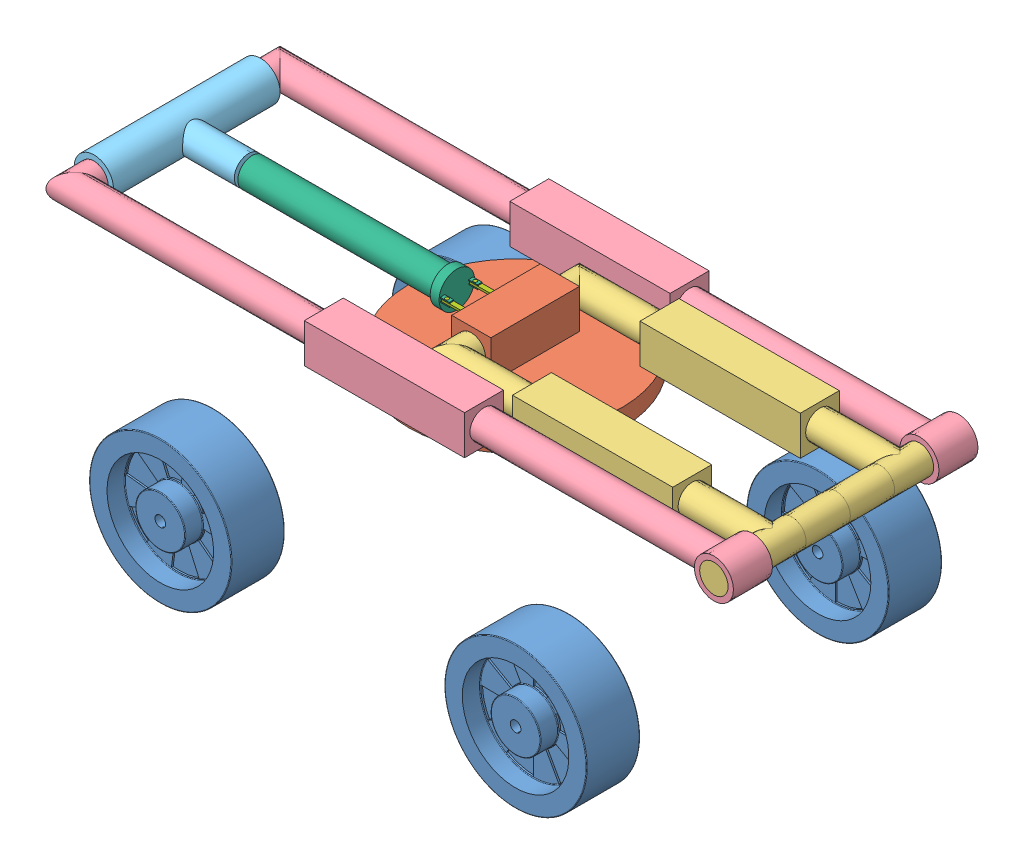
SolidWorks assembly transformer.SLDASM, configuration Default (file format 15000). Lengths in mm.
Overall size (1670.85 1373.55 741.48).
17 component instances, 10 part files, 16 mates.
Components (placement in the parent):
- Axle-1: Axle.SLDPRT [Default] at (-168.9772 90.842 221.0619) x (0 0 1) z (-1 0 0) size (109.09 185.29 14.99)
- Chassis-1: Chassis.SLDPRT [Default] at (-397.5772 211.562 -185.3381) size (965.2 171.4 508)
- Wheels-1: Wheels.SLDPRT [Default] at (-168.9772 90.842 284.5619) x (0 0 1) z (0.805819 -0.592162 0) size (76.2 203.2 203.2)
- Wheels-2: Wheels.SLDPRT [Default] at (-168.9772 90.842 -147.2381) x (0 0 -1) z (-0.923728 -0.383049 0) size (76.2 203.2 203.2)
- Axle-2: Axle.SLDPRT [Default] at (-168.9772 90.842 -83.7381) x (0 0 -1) z (1 0 0) size (109.09 185.29 14.99)
- Wheels-3: Wheels.SLDPRT [Default] at (339.0228 90.842 -147.2381) x (0 0 -1) z (1 0 0) size (76.2 203.2 203.2)
- Axle-3: Axle.SLDPRT [Default] at (339.0228 90.842 -83.7381) x (0 0 -1) z (1 0 0) size (109.09 185.29 14.99)
- Axle-4: Axle.SLDPRT [Default] at (339.0228 90.842 221.0619) x (0 0 1) z (-1 0 0) size (109.09 185.29 14.99)
- Wheels-4: Wheels.SLDPRT [Default] at (339.0228 90.842 284.5619) x (0 0 1) z (-1 0 0) size (76.2 203.2 203.2)
- rotating_base-1: rotating_base.SLDPRT [Default] at (85.0228 282.562 68.6619) x (0.00255 0 0.999997) z (0.999997 0 -0.00255) size (304.8 132.08 304.8)
- link1-3: link1.SLDPRT [Default] at (85.0228 335.902 68.6619) x (0.999997 0 -0.00255) z (-0.00255 0 -0.999997) size (497.84 55.88 350.52)
- link2-3: link2.SLDPRT [Default] at (-397.5756 335.902 69.8928) x (0.999997 0 -0.00255) z (-0.00255 0 -0.999997) size (988.06 55.88 350.52)
- final_link3-1: final_link3.SLDPRT [Default] at (-295.9759 335.902 69.6337) x (-0.999997 0 0.00255) z (0.00255 0 0.999997) size (129.54 55.88 238.76)
- final_link4-1: final_link4.SLDPRT [Default] at (-346.7757 335.902 69.7632) x (-0.002485 0.224515 -0.974467) z (0.999997 0 -0.00255) size (55.88 55.88 309.88)
- link5-2: link5.SLDPRT [Default] at (-290.8959 335.902 69.6207) x (-0.000095 -0.999306 -0.037239) z (0.999997 0 -0.00255) size (50.8 50.8 304.8)
- finger-1: finger.SLDPRT [Default] at (2.4213 336.6587 48.5666) x (0.002549 -0.037239 0.999303) z (0.000095 0.999306 0.037239) size (23.5 41.27 6.35)
- finger-2: finger.SLDPRT [Default] at (2.5249 335.1453 89.1783) x (-0.002549 0.037239 -0.999303) z (-0.000095 -0.999306 -0.037239) size (23.5 41.27 6.35)
Mates (geometry in assembly coordinates):
- Hinge1: hinge aligned: circle of Axle-1; circle of Axle-1; plane of Wheels-1 through (-168.9772 90.842 322.6619) normal (0 0 1); plane of Wheels-1 through (-173.4894 84.7017 322.6619) normal (0 0 1)
- Hinge3: hinge anti-aligned: circle of Axle-1; circle of Axle-1; plane of Chassis-1 through (-168.9772 268.642 284.5619) normal (0 1 0); plane of Chassis-1 through (-168.9772 268.642 284.5619) normal (0 -1 0); plane of Axle-1 through (-168.9772 90.842 322.6619) normal (0 0 1); plane of Chassis-1 through (-397.5772 211.562 322.6619) normal (0 0 1)
- Hinge4: hinge aligned: circle of Axle-4; circle of Axle-4; plane of Wheels-4 through (339.0228 90.842 322.6619) normal (0 0 1); plane of Wheels-4 through (339.0228 98.462 322.6619) normal (0 0 1)
- Hinge5: hinge anti-aligned: circle of Axle-4; circle of Axle-4; plane of Chassis-1 through (339.0228 268.642 284.5619) normal (0 1 0); plane of Chassis-1 through (339.0228 268.642 284.5619) normal (0 -1 0); plane of Axle-4 through (339.0228 90.842 322.6619) normal (0 0 1); plane of Chassis-1 through (-397.5772 211.562 322.6619) normal (0 0 1)
- Hinge6: hinge aligned: circle of Axle-2; circle of Axle-2; plane of Wheels-2 through (-168.9772 90.842 -185.3381) normal (0 0 -1); plane of Wheels-2 through (-166.0583 83.8032 -185.3381) normal (0 0 -1)
- Hinge7: hinge anti-aligned: circle of Axle-2; circle of Chassis-1; plane of Chassis-1 through (-168.9772 268.642 -147.2381) normal (0 -1 0); plane of Chassis-1 through (-168.9772 268.642 -147.2381) normal (0 1 0); plane of Axle-2 through (-168.9772 90.842 -185.3381) normal (0 0 -1); plane of Axle-2 through (-397.5772 211.562 -185.3381) normal (0 0 -1)
- Hinge8: hinge aligned: circle of Axle-3; circle of Axle-3; plane of Wheels-3 through (339.0228 90.842 -185.3381) normal (0 0 -1); plane of Wheels-3 through (339.0228 98.462 -185.3381) normal (0 0 -1)
- Hinge9: hinge anti-aligned: circle of Axle-3; circle of Chassis-1; plane of Chassis-1 through (339.0228 268.642 -147.2381) normal (0 -1 0); plane of Chassis-1 through (339.0228 268.642 -147.2381) normal (0 1 0); plane of Axle-3 through (339.0228 90.842 -185.3381) normal (0 0 -1); plane of Axle-3 through (-397.5772 211.562 -185.3381) normal (0 0 -1)
- Hinge25: hinge anti-aligned: cylinder of rotating_base-1 through (85.0228 231.762 68.6619) axis (0 1 0) radius 25.4; cylinder of Chassis-1 through (85.0228 231.762 68.6619) axis (0 1 0) radius 25.4; plane of Chassis-1 through (-397.5772 231.762 -185.3381) normal (0 1 0); plane of rotating_base-1 through (85.0228 231.762 68.6619) normal (0 -1 0)
- Hinge26: hinge anti-aligned: cylinder of link1-3 through (85.0228 335.902 68.6619) axis (-0.00255 0 -0.999997) radius 20.32; cylinder of rotating_base-1 through (85.4115 335.902 221.0614) axis (-0.00255 0 -0.999997) radius 20.32; plane of rotating_base-1 through (85.1848 363.842 132.1617) normal (0.00255 0 0.999997); plane of link1-3 through (428.0837 363.842 131.2871) normal (-0.00255 0 -0.999997); plane of link1-3 through (85.0228 363.842 68.6619) normal (0 1 0); plane of rotating_base-1 through (85.0228 307.962 68.6619) normal (0 1 0)
- Hinge27: hinge = 3141.5927 mm anti-aligned: cylinder of final_link3-1 through (-398.0816 335.902 -128.5128) axis (0.00255 0 0.999997) radius 27.94; cylinder of link2-3 through (-397.2711 335.902 189.2724) axis (-0.00255 0 -0.999997) radius 20.32; plane of final_link3-1 through (-397.2711 335.902 189.2724) normal (0.00255 0 0.999997); plane of link2-3 through (186.927 363.842 187.7824) normal (-0.00255 0 -0.999997); plane of final_link3-1 through (-295.9759 335.902 69.6337) normal (0.999997 0 -0.00255); plane of link2-3 through (-42.3525 363.842 -78.3337) normal (-0.999997 0 0.00255)
- Hinge29: hinge anti-aligned: cylinder of final_link4-1 through (-295.9759 335.902 69.6337) axis (-0.999997 0 0.00255) radius 20.32; cylinder of final_link3-1 through (-295.9759 335.902 69.6337) axis (-0.999997 0 0.00255) radius 20.32; plane of final_link4-1 through (-295.9759 335.902 69.6337) normal (-0.999997 0 0.00255); plane of final_link3-1 through (-295.9759 335.902 69.6337) normal (0.999997 0 -0.00255)
- Hinge31: hinge aligned: cylinder of finger-1 through (7.5016 339.8315 48.6719) axis (-0.000095 -0.999306 -0.037239) radius 2.54; cylinder of link5-2 through (7.501 333.4859 48.4354) axis (0.000095 0.999306 0.037239) radius 2.54; plane of finger-1 through (2.4216 339.8315 48.6849) normal (0.000095 0.999306 0.037239); plane of link5-2 through (13.9034 339.0748 68.9615) normal (0.000095 0.999306 0.037239)
- Hinge33: hinge anti-aligned: cylinder of link5-2 through (-11.4968 335.902 68.9081) axis (-0.999997 0 0.00255) radius 20.32; cylinder of final_link4-1 through (-290.8959 335.902 69.6207) axis (0.999997 0 -0.00255) radius 20.32; plane of final_link4-1 through (-290.8959 335.902 69.6207) normal (0.999997 0 -0.00255); plane of link5-2 through (-290.8959 335.902 69.6207) normal (-0.999997 0 0.00255)
- Hinge37: hinge aligned: cylinder of finger-2 through (7.6046 331.9725 89.0471) axis (0.000095 0.999306 0.037239) radius 2.54; cylinder of link5-2 through (7.6046 331.9725 89.0471) axis (0.000095 0.999306 0.037239) radius 2.54; plane of link5-2 through (13.9028 332.7292 68.7251) normal (-0.000095 -0.999306 -0.037239); plane of finger-2 through (2.5246 331.9725 89.0601) normal (-0.000095 -0.999306 -0.037239)
- Hinge38: hinge aligned: cylinder of link2-3 through (542.6684 335.902 242.7553) axis (-0.00255 0 -0.999997) radius 20.32; cylinder of link1-3 through (542.5118 335.902 181.3875) axis (-0.00255 0 -0.999997) radius 20.32; plane of link2-3 through (542.6684 335.902 242.7553) normal (0.00255 0 0.999997); plane of link1-3 through (542.6684 335.902 242.7553) normal (0.00255 0 0.999997)
